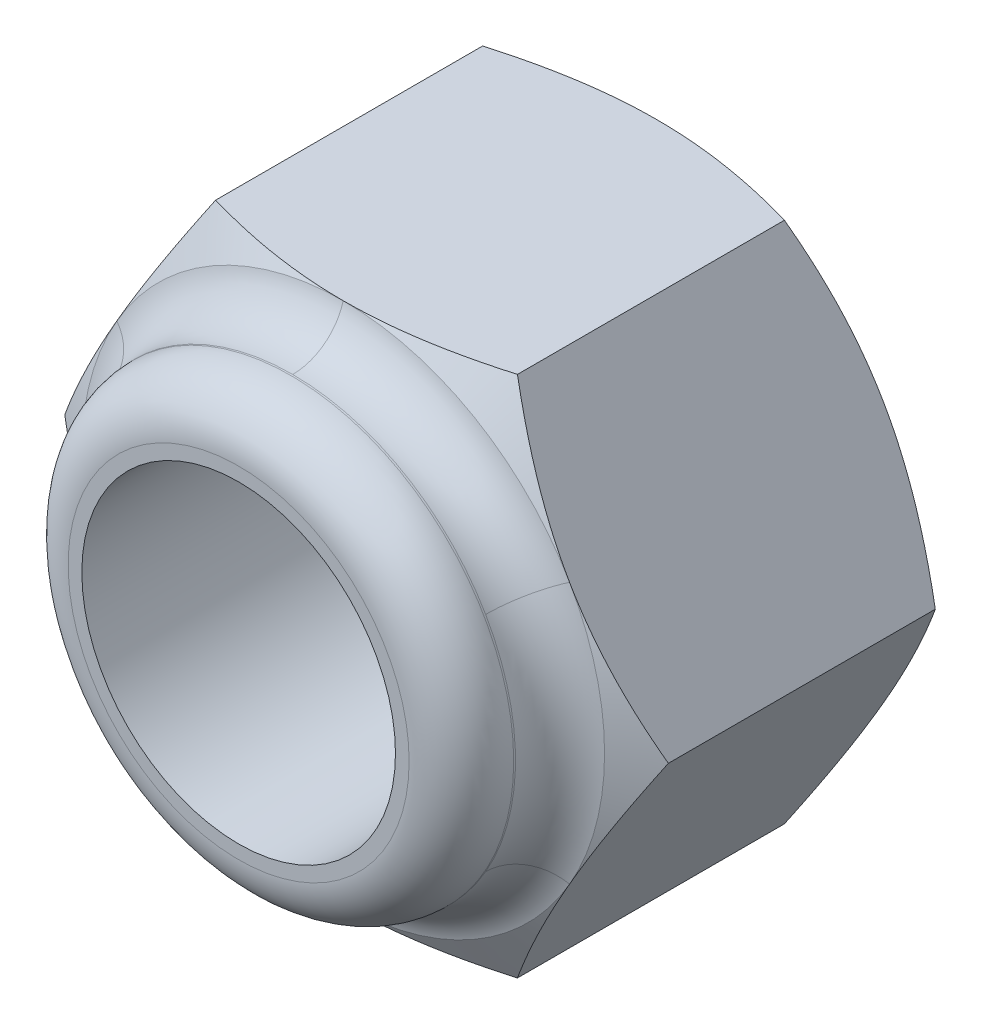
ISO-10303-21;
HEADER;
FILE_DESCRIPTION(('STEP AP214'),'2;1');
FILE_NAME('part.step','',(''),(''),'','','');
FILE_SCHEMA(('AUTOMOTIVE_DESIGN { 1 0 10303 214 1 1 1 1 }'));
ENDSEC;
DATA;
#1=APPLICATION_CONTEXT('core data for automotive mechanical design processes');
#2=APPLICATION_PROTOCOL_DEFINITION('international standard','automotive_design',2000,#1);
#3=PRODUCT_CONTEXT('',#1,'mechanical');
#4=PRODUCT('Part','Part','',(#3));
#5=PRODUCT_RELATED_PRODUCT_CATEGORY('part','',(#4));
#6=PRODUCT_DEFINITION_FORMATION('','',#4);
#7=PRODUCT_DEFINITION_CONTEXT('part definition',#1,'design');
#8=PRODUCT_DEFINITION('design','',#6,#7);
#9=PRODUCT_DEFINITION_SHAPE('','',#8);
#10=(LENGTH_UNIT() NAMED_UNIT(*) SI_UNIT(.MILLI.,.METRE.));
#11=(NAMED_UNIT(*) PLANE_ANGLE_UNIT() SI_UNIT($,.RADIAN.));
#12=(NAMED_UNIT(*) SI_UNIT($,.STERADIAN.) SOLID_ANGLE_UNIT());
#13=UNCERTAINTY_MEASURE_WITH_UNIT(LENGTH_MEASURE(1.E-05),#10,'distance_accuracy_value','');
#14=(GEOMETRIC_REPRESENTATION_CONTEXT(3) GLOBAL_UNCERTAINTY_ASSIGNED_CONTEXT((#13)) GLOBAL_UNIT_ASSIGNED_CONTEXT((#10,
#11,#12)) REPRESENTATION_CONTEXT('',''));
#15=CARTESIAN_POINT('',(0.,0.,0.));
#16=DIRECTION('',(0.,0.,1.));
#17=DIRECTION('',(1.,0.,0.));
#18=AXIS2_PLACEMENT_3D('',#15,#16,#17);
#19=CARTESIAN_POINT('',(-5.77350269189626,0.,6.));
#20=DIRECTION('',(-0.866025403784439,0.5,0.));
#21=DIRECTION('',(-0.5,-0.866025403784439,0.));
#22=AXIS2_PLACEMENT_3D('',#19,#20,#21);
#23=PLANE('',#22);
#24=DIRECTION('',(0.,0.,-1.));
#25=VECTOR('',#24,1.);
#26=CARTESIAN_POINT('',(-5.77350269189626,0.,6.));
#27=LINE('',#26,#25);
#28=CARTESIAN_POINT('',(-5.77350269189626,0.,5.5534180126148));
#29=VERTEX_POINT('',#28);
#30=CARTESIAN_POINT('',(-5.77350269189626,0.,0.446581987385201));
#31=VERTEX_POINT('',#30);
#32=EDGE_CURVE('E171',#29,#31,#27,.T.);
#33=ORIENTED_EDGE('',*,*,#32,.F.);
#34=CARTESIAN_POINT('',(-5.7736181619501,-0.0002,5.55335134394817));
#35=CARTESIAN_POINT('',(-5.64675433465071,0.219534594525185,5.62661343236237));
#36=CARTESIAN_POINT('',(-5.5188054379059,0.441148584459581,5.69324867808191));
#37=CARTESIAN_POINT('',(-5.26069210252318,0.888213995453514,5.80956100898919));
#38=CARTESIAN_POINT('',(-5.13052307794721,1.11367335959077,5.85919695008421));
#39=CARTESIAN_POINT('',(-4.87177839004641,1.56183230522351,5.9364489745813));
#40=CARTESIAN_POINT('',(-4.74324302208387,1.78446209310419,5.96457962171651));
#41=CARTESIAN_POINT('',(-4.54998783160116,2.11918990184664,5.98980507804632));
#42=CARTESIAN_POINT('',(-4.48552534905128,2.23084219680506,5.99538654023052));
#43=CARTESIAN_POINT('',(-4.35654081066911,2.4542499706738,6.00079778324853));
#44=CARTESIAN_POINT('',(-4.2920187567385,2.56600544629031,6.0006277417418));
#45=CARTESIAN_POINT('',(-4.11524635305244,2.87218423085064,5.99224636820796));
#46=CARTESIAN_POINT('',(-4.00305457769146,3.06650608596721,5.97817022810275));
#47=CARTESIAN_POINT('',(-3.77941563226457,3.45386010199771,5.93353474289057));
#48=CARTESIAN_POINT('',(-3.66796924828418,3.64689090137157,5.90296013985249));
#49=CARTESIAN_POINT('',(-3.44387972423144,4.03502534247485,5.82653150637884));
#50=CARTESIAN_POINT('',(-3.3312648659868,4.23007999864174,5.78035362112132));
#51=CARTESIAN_POINT('',(-3.1077146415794,4.61728034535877,5.67554820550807));
#52=CARTESIAN_POINT('',(-2.99677641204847,4.80943099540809,5.61694529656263));
#53=CARTESIAN_POINT('',(-2.88663587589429,5.0002,5.55335134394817));
#54=B_SPLINE_CURVE_WITH_KNOTS('',3,(#34,#35,#36,#37,#38,#39,#40,#41,#42,#43,#44,#45,#46,#47,#48,
#49,#50,#51,#52,#53),.UNSPECIFIED.,.F.,.F.,(4,2,2,2,2,2,2,2,2,4),(0.,0.792555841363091,
1.58701660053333,2.36181537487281,2.74884076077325,3.13585419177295,3.80962362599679,
4.48401723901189,5.17336882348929,5.86136694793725),.UNSPECIFIED.);
#55=CARTESIAN_POINT('',(-4.33012701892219,2.5,6.));
#56=VERTEX_POINT('',#55);
#57=EDGE_CURVE('E151',#29,#56,#54,.T.);
#58=ORIENTED_EDGE('',*,*,#57,.T.);
#59=CARTESIAN_POINT('',(-2.88675134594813,5.,5.5534180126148));
#60=VERTEX_POINT('',#59);
#61=EDGE_CURVE('E141',#56,#60,#54,.T.);
#62=ORIENTED_EDGE('',*,*,#61,.T.);
#63=DIRECTION('',(0.,0.,-1.));
#64=VECTOR('',#63,1.);
#65=CARTESIAN_POINT('',(-2.88675134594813,5.,6.));
#66=LINE('',#65,#64);
#67=CARTESIAN_POINT('',(-2.88675134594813,5.,0.446581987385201));
#68=VERTEX_POINT('',#67);
#69=EDGE_CURVE('E393',#60,#68,#66,.T.);
#70=ORIENTED_EDGE('',*,*,#69,.T.);
#71=CARTESIAN_POINT('',(-2.88663587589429,5.0002,0.446648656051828));
#72=CARTESIAN_POINT('',(-3.01349970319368,4.78046540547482,0.373386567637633));
#73=CARTESIAN_POINT('',(-3.14144859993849,4.55885141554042,0.306751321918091));
#74=CARTESIAN_POINT('',(-3.39956193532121,4.11178600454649,0.190438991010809));
#75=CARTESIAN_POINT('',(-3.52973095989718,3.88632664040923,0.140803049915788));
#76=CARTESIAN_POINT('',(-3.78847564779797,3.43816769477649,0.0635510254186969));
#77=CARTESIAN_POINT('',(-3.91701101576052,3.21553790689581,0.0354203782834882));
#78=CARTESIAN_POINT('',(-4.11026620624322,2.88081009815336,0.0101949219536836));
#79=CARTESIAN_POINT('',(-4.17472868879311,2.76915780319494,0.00461345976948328));
#80=CARTESIAN_POINT('',(-4.30371322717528,2.5457500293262,-0.000797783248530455));
#81=CARTESIAN_POINT('',(-4.36823528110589,2.43399455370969,-0.000627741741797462));
#82=CARTESIAN_POINT('',(-4.54500768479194,2.12781576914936,0.00775363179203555));
#83=CARTESIAN_POINT('',(-4.65719946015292,1.93349391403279,0.0218297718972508));
#84=CARTESIAN_POINT('',(-4.88083840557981,1.54613989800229,0.0664652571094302));
#85=CARTESIAN_POINT('',(-4.9922847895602,1.35310909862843,0.0970398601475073));
#86=CARTESIAN_POINT('',(-5.21637431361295,0.964974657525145,0.173468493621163));
#87=CARTESIAN_POINT('',(-5.32898917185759,0.769920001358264,0.21964637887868));
#88=CARTESIAN_POINT('',(-5.55253939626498,0.382719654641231,0.324451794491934));
#89=CARTESIAN_POINT('',(-5.66347762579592,0.190569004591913,0.383054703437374));
#90=CARTESIAN_POINT('',(-5.7736181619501,-0.000200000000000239,0.446648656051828));
#91=B_SPLINE_CURVE_WITH_KNOTS('',3,(#71,#72,#73,#74,#75,#76,#77,#78,#79,#80,#81,#82,#83,#84,#85,
#86,#87,#88,#89,#90),.UNSPECIFIED.,.F.,.F.,(4,2,2,2,2,2,2,2,2,4),(0.,0.792555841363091,
1.58701660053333,2.36181537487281,2.74884076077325,3.13585419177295,3.80962362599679,
4.48401723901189,5.17336882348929,5.86136694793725),.UNSPECIFIED.);
#92=CARTESIAN_POINT('',(-4.33012701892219,2.5,0.));
#93=VERTEX_POINT('',#92);
#94=EDGE_CURVE('E317',#68,#93,#91,.T.);
#95=ORIENTED_EDGE('',*,*,#94,.T.);
#96=EDGE_CURVE('E312',#93,#31,#91,.T.);
#97=ORIENTED_EDGE('',*,*,#96,.T.);
#98=EDGE_LOOP('',(#33,#58,#62,#70,#95,#97));
#99=FACE_BOUND('',#98,.T.);
#100=ADVANCED_FACE('F33',(#99),#23,.T.);
#101=CARTESIAN_POINT('',(-2.88675134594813,-5.,6.));
#102=DIRECTION('',(-0.866025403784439,-0.5,0.));
#103=DIRECTION('',(0.5,-0.866025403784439,0.));
#104=AXIS2_PLACEMENT_3D('',#101,#102,#103);
#105=PLANE('',#104);
#106=DIRECTION('',(0.,0.,-1.));
#107=VECTOR('',#106,1.);
#108=CARTESIAN_POINT('',(-2.88675134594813,-5.,6.));
#109=LINE('',#108,#107);
#110=CARTESIAN_POINT('',(-2.88675134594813,-5.,5.5534180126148));
#111=VERTEX_POINT('',#110);
#112=CARTESIAN_POINT('',(-2.88675134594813,-5.,0.446581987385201));
#113=VERTEX_POINT('',#112);
#114=EDGE_CURVE('E403',#111,#113,#109,.T.);
#115=ORIENTED_EDGE('',*,*,#114,.F.);
#116=CARTESIAN_POINT('',(-2.88663587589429,-5.0002,5.55335134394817));
#117=CARTESIAN_POINT('',(-3.01349970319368,-4.78046540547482,5.62661343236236));
#118=CARTESIAN_POINT('',(-3.14144859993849,-4.55885141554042,5.69324867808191));
#119=CARTESIAN_POINT('',(-3.39956193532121,-4.11178600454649,5.80956100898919));
#120=CARTESIAN_POINT('',(-3.52973095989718,-3.88632664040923,5.85919695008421));
#121=CARTESIAN_POINT('',(-3.78847564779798,-3.43816769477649,5.9364489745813));
#122=CARTESIAN_POINT('',(-3.91701101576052,-3.21553790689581,5.96457962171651));
#123=CARTESIAN_POINT('',(-4.11026620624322,-2.88081009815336,5.98980507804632));
#124=CARTESIAN_POINT('',(-4.17472868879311,-2.76915780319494,5.99538654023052));
#125=CARTESIAN_POINT('',(-4.30371322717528,-2.5457500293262,6.00079778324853));
#126=CARTESIAN_POINT('',(-4.36823528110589,-2.43399455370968,6.0006277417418));
#127=CARTESIAN_POINT('',(-4.54500768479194,-2.12781576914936,5.99224636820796));
#128=CARTESIAN_POINT('',(-4.65719946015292,-1.93349391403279,5.97817022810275));
#129=CARTESIAN_POINT('',(-4.88083840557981,-1.54613989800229,5.93353474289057));
#130=CARTESIAN_POINT('',(-4.9922847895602,-1.35310909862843,5.90296013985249));
#131=CARTESIAN_POINT('',(-5.21637431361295,-0.964974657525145,5.82653150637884));
#132=CARTESIAN_POINT('',(-5.32898917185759,-0.769920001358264,5.78035362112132));
#133=CARTESIAN_POINT('',(-5.55253939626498,-0.382719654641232,5.67554820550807));
#134=CARTESIAN_POINT('',(-5.66347762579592,-0.190569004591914,5.61694529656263));
#135=CARTESIAN_POINT('',(-5.77361816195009,0.000199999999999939,5.55335134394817));
#136=B_SPLINE_CURVE_WITH_KNOTS('',3,(#116,#117,#118,#119,#120,#121,#122,#123,#124,#125,#126,
#127,#128,#129,#130,#131,#132,#133,#134,#135),.UNSPECIFIED.,.F.,.F.,(4,2,2,2,2,2,2,2,2,4),(0.,
0.792555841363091,1.58701660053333,2.36181537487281,2.74884076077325,3.13585419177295,
3.80962362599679,4.48401723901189,5.17336882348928,5.86136694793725),.UNSPECIFIED.);
#137=CARTESIAN_POINT('',(-4.33012701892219,-2.5,6.));
#138=VERTEX_POINT('',#137);
#139=EDGE_CURVE('E273',#111,#138,#136,.T.);
#140=ORIENTED_EDGE('',*,*,#139,.T.);
#141=EDGE_CURVE('E160',#138,#29,#136,.T.);
#142=ORIENTED_EDGE('',*,*,#141,.T.);
#143=ORIENTED_EDGE('',*,*,#32,.T.);
#144=CARTESIAN_POINT('',(-5.77361816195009,0.0002,0.446648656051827));
#145=CARTESIAN_POINT('',(-5.64675433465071,-0.219534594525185,0.373386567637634));
#146=CARTESIAN_POINT('',(-5.5188054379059,-0.441148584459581,0.306751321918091));
#147=CARTESIAN_POINT('',(-5.26069210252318,-0.888213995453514,0.19043899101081));
#148=CARTESIAN_POINT('',(-5.13052307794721,-1.11367335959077,0.140803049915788));
#149=CARTESIAN_POINT('',(-4.87177839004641,-1.56183230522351,0.0635510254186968));
#150=CARTESIAN_POINT('',(-4.74324302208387,-1.78446209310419,0.0354203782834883));
#151=CARTESIAN_POINT('',(-4.54998783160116,-2.11918990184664,0.0101949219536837));
#152=CARTESIAN_POINT('',(-4.48552534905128,-2.23084219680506,0.0046134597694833));
#153=CARTESIAN_POINT('',(-4.35654081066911,-2.4542499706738,-0.00079778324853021));
#154=CARTESIAN_POINT('',(-4.2920187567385,-2.56600544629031,-0.000627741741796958));
#155=CARTESIAN_POINT('',(-4.11524635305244,-2.87218423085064,0.00775363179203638));
#156=CARTESIAN_POINT('',(-4.00305457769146,-3.06650608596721,0.0218297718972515));
#157=CARTESIAN_POINT('',(-3.77941563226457,-3.45386010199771,0.0664652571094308));
#158=CARTESIAN_POINT('',(-3.66796924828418,-3.64689090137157,0.097039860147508));
#159=CARTESIAN_POINT('',(-3.44387972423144,-4.03502534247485,0.173468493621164));
#160=CARTESIAN_POINT('',(-3.3312648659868,-4.23007999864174,0.21964637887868));
#161=CARTESIAN_POINT('',(-3.1077146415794,-4.61728034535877,0.324451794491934));
#162=CARTESIAN_POINT('',(-2.99677641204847,-4.80943099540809,0.383054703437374));
#163=CARTESIAN_POINT('',(-2.88663587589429,-5.0002,0.446648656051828));
#164=B_SPLINE_CURVE_WITH_KNOTS('',3,(#144,#145,#146,#147,#148,#149,#150,#151,#152,#153,#154,
#155,#156,#157,#158,#159,#160,#161,#162,#163),.UNSPECIFIED.,.F.,.F.,(4,2,2,2,2,2,2,2,2,4),(0.,
0.792555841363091,1.58701660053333,2.36181537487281,2.74884076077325,3.13585419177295,
3.80962362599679,4.48401723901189,5.17336882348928,5.86136694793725),.UNSPECIFIED.);
#165=CARTESIAN_POINT('',(-4.33012701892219,-2.5,0.));
#166=VERTEX_POINT('',#165);
#167=EDGE_CURVE('E311',#31,#166,#164,.T.);
#168=ORIENTED_EDGE('',*,*,#167,.T.);
#169=EDGE_CURVE('E305',#166,#113,#164,.T.);
#170=ORIENTED_EDGE('',*,*,#169,.T.);
#171=EDGE_LOOP('',(#115,#140,#142,#143,#168,#170));
#172=FACE_BOUND('',#171,.T.);
#173=ADVANCED_FACE('F35',(#172),#105,.T.);
#174=CARTESIAN_POINT('',(2.88675134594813,-5.,6.));
#175=DIRECTION('',(0.,-1.,0.));
#176=DIRECTION('',(0.,0.,-1.));
#177=AXIS2_PLACEMENT_3D('',#174,#175,#176);
#178=PLANE('',#177);
#179=DIRECTION('',(0.,0.,-1.));
#180=VECTOR('',#179,1.);
#181=CARTESIAN_POINT('',(2.88675134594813,-5.,6.));
#182=LINE('',#181,#180);
#183=CARTESIAN_POINT('',(2.88675134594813,-5.,5.5534180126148));
#184=VERTEX_POINT('',#183);
#185=CARTESIAN_POINT('',(2.88675134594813,-5.,0.446581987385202));
#186=VERTEX_POINT('',#185);
#187=EDGE_CURVE('E401',#184,#186,#182,.T.);
#188=ORIENTED_EDGE('',*,*,#187,.F.);
#189=CARTESIAN_POINT('',(-7.66597034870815,-5.,3.60258943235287));
#190=CARTESIAN_POINT('',(-7.44636495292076,-5.,3.70875587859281));
#191=CARTESIAN_POINT('',(-7.22624145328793,-5.,3.81386996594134));
#192=CARTESIAN_POINT('',(-6.78467816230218,-5.,4.02139229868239));
#193=CARTESIAN_POINT('',(-6.56323815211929,-5.,4.12380007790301));
#194=CARTESIAN_POINT('',(-6.1175704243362,-5.,4.325846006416));
#195=CARTESIAN_POINT('',(-5.89333401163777,-5.,4.42546504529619));
#196=CARTESIAN_POINT('',(-5.44302179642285,-5.,4.62043845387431));
#197=CARTESIAN_POINT('',(-5.21694609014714,-5.,4.7157930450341));
#198=CARTESIAN_POINT('',(-4.75974332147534,-5.,4.90225488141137));
#199=CARTESIAN_POINT('',(-4.52858843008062,-5.,4.99329426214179));
#200=CARTESIAN_POINT('',(-4.06355549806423,-5.,5.16826743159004));
#201=CARTESIAN_POINT('',(-3.82967715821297,-5.,5.2522004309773));
#202=CARTESIAN_POINT('',(-3.35930314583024,-5.,5.41071302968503));
#203=CARTESIAN_POINT('',(-3.12281421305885,-5.,5.48531242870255));
#204=CARTESIAN_POINT('',(-2.64647143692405,-5.,5.62274061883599));
#205=CARTESIAN_POINT('',(-2.40661868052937,-5.,5.68557312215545));
#206=CARTESIAN_POINT('',(-1.92340007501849,-5.,5.79642571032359));
#207=CARTESIAN_POINT('',(-1.68003342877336,-5.,5.84444237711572));
#208=CARTESIAN_POINT('',(-1.19032080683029,-5.,5.92242694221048));
#209=CARTESIAN_POINT('',(-0.94397483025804,-5.,5.95239483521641));
#210=CARTESIAN_POINT('',(-0.574057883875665,-5.,5.98188923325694));
#211=CARTESIAN_POINT('',(-0.451072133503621,-5.,5.98914564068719));
#212=CARTESIAN_POINT('',(-0.204898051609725,-5.,5.99844609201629));
#213=CARTESIAN_POINT('',(-0.0817097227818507,-5.,6.00049020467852));
#214=CARTESIAN_POINT('',(0.164605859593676,-5.,5.99931142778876));
#215=CARTESIAN_POINT('',(0.28773312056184,-5.,5.99609002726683));
#216=CARTESIAN_POINT('',(0.533744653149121,-5.,5.98446218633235));
#217=CARTESIAN_POINT('',(0.656628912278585,-5.,5.97605548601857));
#218=CARTESIAN_POINT('',(0.954158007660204,-5.,5.94959882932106));
#219=CARTESIAN_POINT('',(1.12857705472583,-5.,5.9289676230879));
#220=CARTESIAN_POINT('',(1.47606089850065,-5.,5.87840458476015));
#221=CARTESIAN_POINT('',(1.649125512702,-5.,5.84847152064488));
#222=CARTESIAN_POINT('',(1.99378931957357,-5.,5.78036333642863));
#223=CARTESIAN_POINT('',(2.16538687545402,-5.,5.74218001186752));
#224=CARTESIAN_POINT('',(2.5068253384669,-5.,5.65873641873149));
#225=CARTESIAN_POINT('',(2.67666635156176,-5.,5.61347657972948));
#226=CARTESIAN_POINT('',(3.01877977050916,-5.,5.515778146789));
#227=CARTESIAN_POINT('',(3.19100929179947,-5.,5.46319041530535));
#228=CARTESIAN_POINT('',(3.53364807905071,-5.,5.3527979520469));
#229=CARTESIAN_POINT('',(3.70405850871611,-5.,5.29499681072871));
#230=CARTESIAN_POINT('',(4.04237551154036,-5.,5.17537322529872));
#231=CARTESIAN_POINT('',(4.21029077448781,-5.,5.11357520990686));
#232=CARTESIAN_POINT('',(4.54481672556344,-5.,4.98633841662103));
#233=CARTESIAN_POINT('',(4.71142685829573,-5.,4.92089817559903));
#234=CARTESIAN_POINT('',(4.87743079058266,-5.,4.85399665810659));
#235=B_SPLINE_CURVE_WITH_KNOTS('',3,(#189,#190,#191,#192,#193,#194,#195,#196,#197,#198,#199,
#200,#201,#202,#203,#204,#205,#206,#207,#208,#209,#210,#211,#212,#213,#214,#215,#216,#217,#218,
#219,#220,#221,#222,#223,#224,#225,#226,#227,#228,#229,#230,#231,#232,#233,#234),.UNSPECIFIED.,
.F.,.F.,(4,2,2,2,2,2,2,2,2,2,2,2,2,2,2,2,2,2,2,2,2,2,4),(0.,0.731775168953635,1.46367557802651,
2.19974713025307,2.93578041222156,3.68100006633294,4.42630238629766,5.1699958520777,
5.91345430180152,6.65708414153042,7.40071419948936,7.77021927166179,8.13971946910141,
8.50911519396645,8.87852943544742,9.40514124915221,9.93182284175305,10.4590306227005,
10.9862064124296,11.5263432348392,12.0661108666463,12.602844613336,13.1397955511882),.UNSPECIFIED.);
#236=CARTESIAN_POINT('',(0.,-5.,6.));
#237=VERTEX_POINT('',#236);
#238=EDGE_CURVE('E280',#184,#237,#235,.F.);
#239=ORIENTED_EDGE('',*,*,#238,.T.);
#240=EDGE_CURVE('E274',#237,#111,#235,.F.);
#241=ORIENTED_EDGE('',*,*,#240,.T.);
#242=ORIENTED_EDGE('',*,*,#114,.T.);
#243=CARTESIAN_POINT('',(-7.65902487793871,-5.,2.39405232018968));
#244=CARTESIAN_POINT('',(-7.43947373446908,-5.,2.28794089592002));
#245=CARTESIAN_POINT('',(-7.21940383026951,-5.,2.1828834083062));
#246=CARTESIAN_POINT('',(-6.77794602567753,-5.,1.97547849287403));
#247=CARTESIAN_POINT('',(-6.55655790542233,-5.,1.87313153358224));
#248=CARTESIAN_POINT('',(-6.11098872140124,-5.,1.67121133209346));
#249=CARTESIAN_POINT('',(-5.88679892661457,-5.,1.57165728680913));
#250=CARTESIAN_POINT('',(-5.43657776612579,-5.,1.37682106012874));
#251=CARTESIAN_POINT('',(-5.21054649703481,-5.,1.28153865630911));
#252=CARTESIAN_POINT('',(-4.75346330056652,-5.,1.09524467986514));
#253=CARTESIAN_POINT('',(-4.52238383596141,-5.,1.00430030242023));
#254=CARTESIAN_POINT('',(-4.05750017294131,-5.,0.829527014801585));
#255=CARTESIAN_POINT('',(-3.82369567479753,-5.,0.745698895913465));
#256=CARTESIAN_POINT('',(-3.35347003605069,-5.,0.587408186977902));
#257=CARTESIAN_POINT('',(-3.11705565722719,-5.,0.512925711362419));
#258=CARTESIAN_POINT('',(-2.64086337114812,-5.,0.375744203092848));
#259=CARTESIAN_POINT('',(-2.40108655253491,-5.,0.313041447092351));
#260=CARTESIAN_POINT('',(-1.91801837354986,-5.,0.202458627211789));
#261=CARTESIAN_POINT('',(-1.67472613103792,-5.,0.154582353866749));
#262=CARTESIAN_POINT('',(-1.18517100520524,-5.,0.0768854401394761));
#263=CARTESIAN_POINT('',(-0.938908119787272,-5.,0.0470648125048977));
#264=CARTESIAN_POINT('',(-0.569120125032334,-5.,0.0177871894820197));
#265=CARTESIAN_POINT('',(-0.446175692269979,-5.,0.0106021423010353));
#266=CARTESIAN_POINT('',(-0.200087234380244,-5.,0.0014419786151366));
#267=CARTESIAN_POINT('',(-0.0769432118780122,-5.,-0.000533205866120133));
#268=CARTESIAN_POINT('',(0.169281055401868,-5.,0.000779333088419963));
#269=CARTESIAN_POINT('',(0.292361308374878,-5.,0.00406557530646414));
#270=CARTESIAN_POINT('',(0.538276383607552,-5.,0.0158175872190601));
#271=CARTESIAN_POINT('',(0.661111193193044,-5.,0.0242836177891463));
#272=CARTESIAN_POINT('',(0.958742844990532,-5.,0.0508962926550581));
#273=CARTESIAN_POINT('',(1.13331178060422,-5.,0.0716338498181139));
#274=CARTESIAN_POINT('',(1.48108954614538,-5.,0.122417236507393));
#275=CARTESIAN_POINT('',(1.65429819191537,-5.,0.152464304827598));
#276=CARTESIAN_POINT('',(1.99924567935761,-5.,0.220804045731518));
#277=CARTESIAN_POINT('',(2.17098287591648,-5.,0.259104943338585));
#278=CARTESIAN_POINT('',(2.51269698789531,-5.,0.342784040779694));
#279=CARTESIAN_POINT('',(2.68267400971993,-5.,0.388161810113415));
#280=CARTESIAN_POINT('',(3.0250496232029,-5.,0.486094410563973));
#281=CARTESIAN_POINT('',(3.19740538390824,-5.,0.53879795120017));
#282=CARTESIAN_POINT('',(3.5402951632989,-5.,0.649418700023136));
#283=CARTESIAN_POINT('',(3.71083034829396,-5.,0.707332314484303));
#284=CARTESIAN_POINT('',(4.04939473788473,-5.,0.827176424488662));
#285=CARTESIAN_POINT('',(4.21743264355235,-5.,0.889082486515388));
#286=CARTESIAN_POINT('',(4.55220418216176,-5.,1.01653217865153));
#287=CARTESIAN_POINT('',(4.7189372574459,-5.,1.08207727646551));
#288=CARTESIAN_POINT('',(4.8850643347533,-5.,1.14908204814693));
#289=B_SPLINE_CURVE_WITH_KNOTS('',3,(#243,#244,#245,#246,#247,#248,#249,#250,#251,#252,#253,
#254,#255,#256,#257,#258,#259,#260,#261,#262,#263,#264,#265,#266,#267,#268,#269,#270,#271,#272,
#273,#274,#275,#276,#277,#278,#279,#280,#281,#282,#283,#284,#285,#286,#287,#288),.UNSPECIFIED.,
.F.,.F.,(4,2,2,2,2,2,2,2,2,2,2,2,2,2,2,2,2,2,2,2,2,2,4),(0.,0.731556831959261,1.46323930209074,
2.19910377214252,2.93492988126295,3.67983429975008,4.42482143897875,5.16819550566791,
5.91133420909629,6.65466274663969,7.39799180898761,7.76736064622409,8.1367246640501,
8.50598471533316,8.87526336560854,9.40235883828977,9.92952448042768,10.4572178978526,
10.9848792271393,11.5254799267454,12.0657105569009,12.6029016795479,13.1403110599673),.UNSPECIFIED.);
#290=CARTESIAN_POINT('',(0.,-5.,0.));
#291=VERTEX_POINT('',#290);
#292=EDGE_CURVE('E299',#113,#291,#289,.T.);
#293=ORIENTED_EDGE('',*,*,#292,.T.);
#294=EDGE_CURVE('E292',#291,#186,#289,.T.);
#295=ORIENTED_EDGE('',*,*,#294,.T.);
#296=EDGE_LOOP('',(#188,#239,#241,#242,#293,#295));
#297=FACE_BOUND('',#296,.T.);
#298=ADVANCED_FACE('F284',(#297),#178,.T.);
#299=CARTESIAN_POINT('',(5.77350269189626,0.,6.));
#300=DIRECTION('',(0.866025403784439,-0.5,0.));
#301=DIRECTION('',(0.5,0.866025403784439,0.));
#302=AXIS2_PLACEMENT_3D('',#299,#300,#301);
#303=PLANE('',#302);
#304=DIRECTION('',(0.,0.,-1.));
#305=VECTOR('',#304,1.);
#306=CARTESIAN_POINT('',(5.77350269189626,0.,6.));
#307=LINE('',#306,#305);
#308=CARTESIAN_POINT('',(5.77350269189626,0.,5.5534180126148));
#309=VERTEX_POINT('',#308);
#310=CARTESIAN_POINT('',(5.77350269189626,0.,0.446581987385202));
#311=VERTEX_POINT('',#310);
#312=EDGE_CURVE('E387',#309,#311,#307,.T.);
#313=ORIENTED_EDGE('',*,*,#312,.F.);
#314=CARTESIAN_POINT('',(5.7736181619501,0.000200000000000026,5.55335134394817));
#315=CARTESIAN_POINT('',(5.64675433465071,-0.219534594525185,5.62661343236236));
#316=CARTESIAN_POINT('',(5.5188054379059,-0.441148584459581,5.69324867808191));
#317=CARTESIAN_POINT('',(5.26069210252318,-0.888213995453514,5.80956100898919));
#318=CARTESIAN_POINT('',(5.13052307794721,-1.11367335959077,5.85919695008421));
#319=CARTESIAN_POINT('',(4.87177839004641,-1.56183230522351,5.9364489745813));
#320=CARTESIAN_POINT('',(4.74324302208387,-1.78446209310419,5.96457962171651));
#321=CARTESIAN_POINT('',(4.54998783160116,-2.11918990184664,5.98980507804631));
#322=CARTESIAN_POINT('',(4.48552534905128,-2.23084219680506,5.99538654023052));
#323=CARTESIAN_POINT('',(4.35654081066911,-2.4542499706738,6.00079778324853));
#324=CARTESIAN_POINT('',(4.2920187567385,-2.56600544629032,6.0006277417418));
#325=CARTESIAN_POINT('',(4.11524635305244,-2.87218423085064,5.99224636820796));
#326=CARTESIAN_POINT('',(4.00305457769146,-3.06650608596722,5.97817022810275));
#327=CARTESIAN_POINT('',(3.77941563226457,-3.45386010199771,5.93353474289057));
#328=CARTESIAN_POINT('',(3.66796924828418,-3.64689090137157,5.90296013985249));
#329=CARTESIAN_POINT('',(3.44387972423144,-4.03502534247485,5.82653150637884));
#330=CARTESIAN_POINT('',(3.3312648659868,-4.23007999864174,5.78035362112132));
#331=CARTESIAN_POINT('',(3.1077146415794,-4.61728034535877,5.67554820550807));
#332=CARTESIAN_POINT('',(2.99677641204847,-4.80943099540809,5.61694529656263));
#333=CARTESIAN_POINT('',(2.88663587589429,-5.0002,5.55335134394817));
#334=B_SPLINE_CURVE_WITH_KNOTS('',3,(#314,#315,#316,#317,#318,#319,#320,#321,#322,#323,#324,
#325,#326,#327,#328,#329,#330,#331,#332,#333),.UNSPECIFIED.,.F.,.F.,(4,2,2,2,2,2,2,2,2,4),(0.,
0.792555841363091,1.58701660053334,2.36181537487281,2.74884076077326,3.13585419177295,
3.80962362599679,4.48401723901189,5.17336882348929,5.86136694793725),.UNSPECIFIED.);
#335=CARTESIAN_POINT('',(4.33012701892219,-2.5,6.));
#336=VERTEX_POINT('',#335);
#337=EDGE_CURVE('E264',#309,#336,#334,.T.);
#338=ORIENTED_EDGE('',*,*,#337,.T.);
#339=EDGE_CURVE('E281',#336,#184,#334,.T.);
#340=ORIENTED_EDGE('',*,*,#339,.T.);
#341=ORIENTED_EDGE('',*,*,#187,.T.);
#342=CARTESIAN_POINT('',(2.88663587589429,-5.0002,0.446648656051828));
#343=CARTESIAN_POINT('',(3.01349970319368,-4.78046540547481,0.373386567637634));
#344=CARTESIAN_POINT('',(3.14144859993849,-4.55885141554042,0.306751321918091));
#345=CARTESIAN_POINT('',(3.39956193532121,-4.11178600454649,0.19043899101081));
#346=CARTESIAN_POINT('',(3.52973095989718,-3.88632664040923,0.140803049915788));
#347=CARTESIAN_POINT('',(3.78847564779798,-3.43816769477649,0.0635510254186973));
#348=CARTESIAN_POINT('',(3.91701101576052,-3.21553790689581,0.0354203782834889));
#349=CARTESIAN_POINT('',(4.11026620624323,-2.88081009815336,0.010194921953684));
#350=CARTESIAN_POINT('',(4.17472868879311,-2.76915780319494,0.00461345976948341));
#351=CARTESIAN_POINT('',(4.30371322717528,-2.5457500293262,-0.00079778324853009));
#352=CARTESIAN_POINT('',(4.36823528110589,-2.43399455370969,-0.000627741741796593));
#353=CARTESIAN_POINT('',(4.54500768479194,-2.12781576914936,0.00775363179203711));
#354=CARTESIAN_POINT('',(4.65719946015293,-1.93349391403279,0.021829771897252));
#355=CARTESIAN_POINT('',(4.88083840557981,-1.54613989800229,0.0664652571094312));
#356=CARTESIAN_POINT('',(4.9922847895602,-1.35310909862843,0.0970398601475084));
#357=CARTESIAN_POINT('',(5.21637431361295,-0.964974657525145,0.173468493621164));
#358=CARTESIAN_POINT('',(5.32898917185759,-0.769920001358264,0.21964637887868));
#359=CARTESIAN_POINT('',(5.55253939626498,-0.382719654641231,0.324451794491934));
#360=CARTESIAN_POINT('',(5.66347762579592,-0.190569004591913,0.383054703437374));
#361=CARTESIAN_POINT('',(5.7736181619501,0.000199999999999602,0.446648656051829));
#362=B_SPLINE_CURVE_WITH_KNOTS('',3,(#342,#343,#344,#345,#346,#347,#348,#349,#350,#351,#352,
#353,#354,#355,#356,#357,#358,#359,#360,#361),.UNSPECIFIED.,.F.,.F.,(4,2,2,2,2,2,2,2,2,4),(0.,
0.792555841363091,1.58701660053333,2.36181537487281,2.74884076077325,3.13585419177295,
3.80962362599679,4.48401723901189,5.17336882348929,5.86136694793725),.UNSPECIFIED.);
#363=CARTESIAN_POINT('',(4.33012701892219,-2.5,0.));
#364=VERTEX_POINT('',#363);
#365=EDGE_CURVE('E300',#186,#364,#362,.T.);
#366=ORIENTED_EDGE('',*,*,#365,.T.);
#367=EDGE_CURVE('E301',#364,#311,#362,.T.);
#368=ORIENTED_EDGE('',*,*,#367,.T.);
#369=EDGE_LOOP('',(#313,#338,#340,#341,#366,#368));
#370=FACE_BOUND('',#369,.T.);
#371=ADVANCED_FACE('F287',(#370),#303,.T.);
#372=CARTESIAN_POINT('',(2.88675134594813,5.,6.));
#373=DIRECTION('',(0.866025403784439,0.5,0.));
#374=DIRECTION('',(-0.5,0.866025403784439,0.));
#375=AXIS2_PLACEMENT_3D('',#372,#373,#374);
#376=PLANE('',#375);
#377=DIRECTION('',(0.,0.,-1.));
#378=VECTOR('',#377,1.);
#379=CARTESIAN_POINT('',(2.88675134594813,5.,6.));
#380=LINE('',#379,#378);
#381=CARTESIAN_POINT('',(2.88675134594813,5.,5.5534180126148));
#382=VERTEX_POINT('',#381);
#383=CARTESIAN_POINT('',(2.88675134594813,5.,0.446581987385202));
#384=VERTEX_POINT('',#383);
#385=EDGE_CURVE('E397',#382,#384,#380,.T.);
#386=ORIENTED_EDGE('',*,*,#385,.F.);
#387=CARTESIAN_POINT('',(2.88663587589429,5.0002,5.55335134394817));
#388=CARTESIAN_POINT('',(3.01349970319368,4.78046540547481,5.62661343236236));
#389=CARTESIAN_POINT('',(3.14144859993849,4.55885141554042,5.69324867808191));
#390=CARTESIAN_POINT('',(3.39956193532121,4.11178600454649,5.80956100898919));
#391=CARTESIAN_POINT('',(3.52973095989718,3.88632664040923,5.85919695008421));
#392=CARTESIAN_POINT('',(3.78847564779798,3.43816769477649,5.9364489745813));
#393=CARTESIAN_POINT('',(3.91701101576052,3.21553790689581,5.96457962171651));
#394=CARTESIAN_POINT('',(4.11026620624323,2.88081009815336,5.98980507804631));
#395=CARTESIAN_POINT('',(4.17472868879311,2.76915780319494,5.99538654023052));
#396=CARTESIAN_POINT('',(4.30371322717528,2.5457500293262,6.00079778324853));
#397=CARTESIAN_POINT('',(4.36823528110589,2.43399455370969,6.0006277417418));
#398=CARTESIAN_POINT('',(4.54500768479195,2.12781576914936,5.99224636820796));
#399=CARTESIAN_POINT('',(4.65719946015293,1.93349391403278,5.97817022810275));
#400=CARTESIAN_POINT('',(4.88083840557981,1.54613989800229,5.93353474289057));
#401=CARTESIAN_POINT('',(4.9922847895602,1.35310909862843,5.90296013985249));
#402=CARTESIAN_POINT('',(5.21637431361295,0.964974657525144,5.82653150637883));
#403=CARTESIAN_POINT('',(5.32898917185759,0.769920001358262,5.78035362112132));
#404=CARTESIAN_POINT('',(5.55253939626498,0.38271965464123,5.67554820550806));
#405=CARTESIAN_POINT('',(5.66347762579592,0.190569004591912,5.61694529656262));
#406=CARTESIAN_POINT('',(5.7736181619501,-0.000200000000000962,5.55335134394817));
#407=B_SPLINE_CURVE_WITH_KNOTS('',3,(#387,#388,#389,#390,#391,#392,#393,#394,#395,#396,#397,
#398,#399,#400,#401,#402,#403,#404,#405,#406),.UNSPECIFIED.,.F.,.F.,(4,2,2,2,2,2,2,2,2,4),(0.,
0.792555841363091,1.58701660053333,2.36181537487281,2.74884076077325,3.13585419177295,
3.80962362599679,4.48401723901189,5.17336882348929,5.86136694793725),.UNSPECIFIED.);
#408=CARTESIAN_POINT('',(4.33012701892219,2.5,6.));
#409=VERTEX_POINT('',#408);
#410=EDGE_CURVE('E152',#382,#409,#407,.T.);
#411=ORIENTED_EDGE('',*,*,#410,.T.);
#412=EDGE_CURVE('E172',#409,#309,#407,.T.);
#413=ORIENTED_EDGE('',*,*,#412,.T.);
#414=ORIENTED_EDGE('',*,*,#312,.T.);
#415=CARTESIAN_POINT('',(5.7736181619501,-0.000200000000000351,0.446648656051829));
#416=CARTESIAN_POINT('',(5.64675433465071,0.219534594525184,0.373386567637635));
#417=CARTESIAN_POINT('',(5.5188054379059,0.44114858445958,0.306751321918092));
#418=CARTESIAN_POINT('',(5.26069210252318,0.888213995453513,0.190438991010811));
#419=CARTESIAN_POINT('',(5.13052307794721,1.11367335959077,0.140803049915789));
#420=CARTESIAN_POINT('',(4.87177839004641,1.56183230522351,0.0635510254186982));
#421=CARTESIAN_POINT('',(4.74324302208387,1.78446209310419,0.0354203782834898));
#422=CARTESIAN_POINT('',(4.54998783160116,2.11918990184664,0.0101949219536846));
#423=CARTESIAN_POINT('',(4.48552534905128,2.23084219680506,0.00461345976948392));
#424=CARTESIAN_POINT('',(4.35654081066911,2.4542499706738,-0.000797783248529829));
#425=CARTESIAN_POINT('',(4.2920187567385,2.56600544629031,-0.000627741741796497));
#426=CARTESIAN_POINT('',(4.11524635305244,2.87218423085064,0.00775363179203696));
#427=CARTESIAN_POINT('',(4.00305457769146,3.06650608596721,0.021829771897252));
#428=CARTESIAN_POINT('',(3.77941563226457,3.45386010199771,0.0664652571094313));
#429=CARTESIAN_POINT('',(3.66796924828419,3.64689090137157,0.0970398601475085));
#430=CARTESIAN_POINT('',(3.44387972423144,4.03502534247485,0.173468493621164));
#431=CARTESIAN_POINT('',(3.3312648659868,4.23007999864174,0.21964637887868));
#432=CARTESIAN_POINT('',(3.1077146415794,4.61728034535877,0.324451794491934));
#433=CARTESIAN_POINT('',(2.99677641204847,4.80943099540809,0.383054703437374));
#434=CARTESIAN_POINT('',(2.88663587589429,5.0002,0.446648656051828));
#435=B_SPLINE_CURVE_WITH_KNOTS('',3,(#415,#416,#417,#418,#419,#420,#421,#422,#423,#424,#425,
#426,#427,#428,#429,#430,#431,#432,#433,#434),.UNSPECIFIED.,.F.,.F.,(4,2,2,2,2,2,2,2,2,4),(0.,
0.792555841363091,1.58701660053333,2.36181537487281,2.74884076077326,3.13585419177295,
3.80962362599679,4.48401723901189,5.17336882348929,5.86136694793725),.UNSPECIFIED.);
#436=CARTESIAN_POINT('',(4.33012701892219,2.5,0.));
#437=VERTEX_POINT('',#436);
#438=EDGE_CURVE('E421',#311,#437,#435,.T.);
#439=ORIENTED_EDGE('',*,*,#438,.T.);
#440=EDGE_CURVE('E420',#437,#384,#435,.T.);
#441=ORIENTED_EDGE('',*,*,#440,.T.);
#442=EDGE_LOOP('',(#386,#411,#413,#414,#439,#441));
#443=FACE_BOUND('',#442,.T.);
#444=ADVANCED_FACE('F447',(#443),#376,.T.);
#445=CARTESIAN_POINT('',(-2.88675134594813,5.,6.));
#446=DIRECTION('',(0.,1.,0.));
#447=DIRECTION('',(0.,0.,1.));
#448=AXIS2_PLACEMENT_3D('',#445,#446,#447);
#449=PLANE('',#448);
#450=ORIENTED_EDGE('',*,*,#69,.F.);
#451=CARTESIAN_POINT('',(-7.66597034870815,5.,3.60258943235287));
#452=CARTESIAN_POINT('',(-7.44636495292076,5.,3.70875587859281));
#453=CARTESIAN_POINT('',(-7.22624145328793,5.,3.81386996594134));
#454=CARTESIAN_POINT('',(-6.78467816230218,5.,4.02139229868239));
#455=CARTESIAN_POINT('',(-6.56323815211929,5.,4.12380007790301));
#456=CARTESIAN_POINT('',(-6.1175704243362,5.,4.325846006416));
#457=CARTESIAN_POINT('',(-5.89333401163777,5.,4.42546504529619));
#458=CARTESIAN_POINT('',(-5.44302179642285,5.,4.62043845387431));
#459=CARTESIAN_POINT('',(-5.21694609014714,5.,4.7157930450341));
#460=CARTESIAN_POINT('',(-4.75974332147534,5.,4.90225488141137));
#461=CARTESIAN_POINT('',(-4.52858843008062,5.,4.99329426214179));
#462=CARTESIAN_POINT('',(-4.06355549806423,5.,5.16826743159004));
#463=CARTESIAN_POINT('',(-3.82967715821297,5.,5.2522004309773));
#464=CARTESIAN_POINT('',(-3.35930314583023,5.,5.41071302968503));
#465=CARTESIAN_POINT('',(-3.12281421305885,5.,5.48531242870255));
#466=CARTESIAN_POINT('',(-2.64647143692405,5.,5.62274061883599));
#467=CARTESIAN_POINT('',(-2.40661868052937,5.,5.68557312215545));
#468=CARTESIAN_POINT('',(-1.92340007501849,5.,5.79642571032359));
#469=CARTESIAN_POINT('',(-1.68003342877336,5.,5.84444237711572));
#470=CARTESIAN_POINT('',(-1.19032080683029,5.,5.92242694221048));
#471=CARTESIAN_POINT('',(-0.943974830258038,5.,5.95239483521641));
#472=CARTESIAN_POINT('',(-0.574057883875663,5.,5.98188923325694));
#473=CARTESIAN_POINT('',(-0.451072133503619,5.,5.98914564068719));
#474=CARTESIAN_POINT('',(-0.204898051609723,5.,5.99844609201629));
#475=CARTESIAN_POINT('',(-0.0817097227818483,5.,6.00049020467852));
#476=CARTESIAN_POINT('',(0.164605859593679,5.,5.99931142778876));
#477=CARTESIAN_POINT('',(0.287733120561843,5.,5.99609002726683));
#478=CARTESIAN_POINT('',(0.533744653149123,5.,5.98446218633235));
#479=CARTESIAN_POINT('',(0.656628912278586,5.,5.97605548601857));
#480=CARTESIAN_POINT('',(0.954158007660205,5.,5.94959882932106));
#481=CARTESIAN_POINT('',(1.12857705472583,5.,5.9289676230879));
#482=CARTESIAN_POINT('',(1.47606089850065,5.,5.87840458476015));
#483=CARTESIAN_POINT('',(1.64912551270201,5.,5.84847152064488));
#484=CARTESIAN_POINT('',(1.99378931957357,5.,5.78036333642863));
#485=CARTESIAN_POINT('',(2.16538687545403,5.,5.74218001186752));
#486=CARTESIAN_POINT('',(2.5068253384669,5.,5.65873641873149));
#487=CARTESIAN_POINT('',(2.67666635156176,5.,5.61347657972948));
#488=CARTESIAN_POINT('',(3.01877977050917,5.,5.515778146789));
#489=CARTESIAN_POINT('',(3.19100929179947,5.,5.46319041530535));
#490=CARTESIAN_POINT('',(3.53364807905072,5.,5.3527979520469));
#491=CARTESIAN_POINT('',(3.70405850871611,5.,5.2949968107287));
#492=CARTESIAN_POINT('',(4.04237551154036,5.,5.17537322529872));
#493=CARTESIAN_POINT('',(4.21029077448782,5.,5.11357520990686));
#494=CARTESIAN_POINT('',(4.54481672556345,5.,4.98633841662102));
#495=CARTESIAN_POINT('',(4.71142685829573,5.,4.92089817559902));
#496=CARTESIAN_POINT('',(4.87743079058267,5.,4.85399665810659));
#497=B_SPLINE_CURVE_WITH_KNOTS('',3,(#451,#452,#453,#454,#455,#456,#457,#458,#459,#460,#461,
#462,#463,#464,#465,#466,#467,#468,#469,#470,#471,#472,#473,#474,#475,#476,#477,#478,#479,#480,
#481,#482,#483,#484,#485,#486,#487,#488,#489,#490,#491,#492,#493,#494,#495,#496),.UNSPECIFIED.,
.F.,.F.,(4,2,2,2,2,2,2,2,2,2,2,2,2,2,2,2,2,2,2,2,2,2,4),(0.,0.731775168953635,1.46367557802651,
2.19974713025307,2.93578041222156,3.68100006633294,4.42630238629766,5.16999585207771,
5.91345430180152,6.65708414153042,7.40071419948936,7.77021927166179,8.13971946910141,
8.50911519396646,8.87852943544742,9.40514124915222,9.93182284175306,10.4590306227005,
10.9862064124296,11.5263432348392,12.0661108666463,12.602844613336,13.1397955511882),.UNSPECIFIED.);
#498=CARTESIAN_POINT('',(0.,5.,6.));
#499=VERTEX_POINT('',#498);
#500=EDGE_CURVE('E147',#60,#499,#497,.T.);
#501=ORIENTED_EDGE('',*,*,#500,.T.);
#502=EDGE_CURVE('E229',#499,#382,#497,.T.);
#503=ORIENTED_EDGE('',*,*,#502,.T.);
#504=ORIENTED_EDGE('',*,*,#385,.T.);
#505=CARTESIAN_POINT('',(-7.65902487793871,5.,2.39405232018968));
#506=CARTESIAN_POINT('',(-7.43947373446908,5.,2.28794089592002));
#507=CARTESIAN_POINT('',(-7.21940383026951,5.,2.1828834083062));
#508=CARTESIAN_POINT('',(-6.77794602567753,5.,1.97547849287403));
#509=CARTESIAN_POINT('',(-6.55655790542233,5.,1.87313153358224));
#510=CARTESIAN_POINT('',(-6.11098872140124,5.,1.67121133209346));
#511=CARTESIAN_POINT('',(-5.88679892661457,5.,1.57165728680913));
#512=CARTESIAN_POINT('',(-5.43657776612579,5.,1.37682106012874));
#513=CARTESIAN_POINT('',(-5.21054649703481,5.,1.28153865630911));
#514=CARTESIAN_POINT('',(-4.75346330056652,5.,1.09524467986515));
#515=CARTESIAN_POINT('',(-4.52238383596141,5.,1.00430030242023));
#516=CARTESIAN_POINT('',(-4.05750017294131,5.,0.829527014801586));
#517=CARTESIAN_POINT('',(-3.82369567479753,5.,0.745698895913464));
#518=CARTESIAN_POINT('',(-3.35347003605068,5.,0.587408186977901));
#519=CARTESIAN_POINT('',(-3.11705565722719,5.,0.512925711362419));
#520=CARTESIAN_POINT('',(-2.64086337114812,5.,0.375744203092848));
#521=CARTESIAN_POINT('',(-2.40108655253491,5.,0.31304144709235));
#522=CARTESIAN_POINT('',(-1.91801837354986,5.,0.202458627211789));
#523=CARTESIAN_POINT('',(-1.67472613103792,5.,0.154582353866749));
#524=CARTESIAN_POINT('',(-1.18517100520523,5.,0.0768854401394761));
#525=CARTESIAN_POINT('',(-0.93890811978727,5.,0.0470648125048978));
#526=CARTESIAN_POINT('',(-0.569120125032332,5.,0.0177871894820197));
#527=CARTESIAN_POINT('',(-0.446175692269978,5.,0.0106021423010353));
#528=CARTESIAN_POINT('',(-0.200087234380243,5.,0.00144197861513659));
#529=CARTESIAN_POINT('',(-0.0769432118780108,5.,-0.000533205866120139));
#530=CARTESIAN_POINT('',(0.169281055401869,5.,0.000779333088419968));
#531=CARTESIAN_POINT('',(0.292361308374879,5.,0.00406557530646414));
#532=CARTESIAN_POINT('',(0.538276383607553,5.,0.0158175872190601));
#533=CARTESIAN_POINT('',(0.661111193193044,5.,0.0242836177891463));
#534=CARTESIAN_POINT('',(0.958742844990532,5.,0.0508962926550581));
#535=CARTESIAN_POINT('',(1.13331178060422,5.,0.0716338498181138));
#536=CARTESIAN_POINT('',(1.48108954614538,5.,0.122417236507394));
#537=CARTESIAN_POINT('',(1.65429819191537,5.,0.152464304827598));
#538=CARTESIAN_POINT('',(1.9992456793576,5.,0.220804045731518));
#539=CARTESIAN_POINT('',(2.17098287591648,5.,0.259104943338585));
#540=CARTESIAN_POINT('',(2.51269698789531,5.,0.342784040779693));
#541=CARTESIAN_POINT('',(2.68267400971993,5.,0.388161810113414));
#542=CARTESIAN_POINT('',(3.0250496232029,5.,0.486094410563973));
#543=CARTESIAN_POINT('',(3.19740538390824,5.,0.53879795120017));
#544=CARTESIAN_POINT('',(3.5402951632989,5.,0.649418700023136));
#545=CARTESIAN_POINT('',(3.71083034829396,5.,0.707332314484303));
#546=CARTESIAN_POINT('',(4.04939473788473,5.,0.827176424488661));
#547=CARTESIAN_POINT('',(4.21743264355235,5.,0.889082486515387));
#548=CARTESIAN_POINT('',(4.55220418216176,5.,1.01653217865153));
#549=CARTESIAN_POINT('',(4.71893725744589,5.,1.08207727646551));
#550=CARTESIAN_POINT('',(4.8850643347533,5.,1.14908204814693));
#551=B_SPLINE_CURVE_WITH_KNOTS('',3,(#505,#506,#507,#508,#509,#510,#511,#512,#513,#514,#515,
#516,#517,#518,#519,#520,#521,#522,#523,#524,#525,#526,#527,#528,#529,#530,#531,#532,#533,#534,
#535,#536,#537,#538,#539,#540,#541,#542,#543,#544,#545,#546,#547,#548,#549,#550),.UNSPECIFIED.,
.F.,.F.,(4,2,2,2,2,2,2,2,2,2,2,2,2,2,2,2,2,2,2,2,2,2,4),(0.,0.731556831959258,1.46323930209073,
2.19910377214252,2.93492988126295,3.67983429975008,4.42482143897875,5.16819550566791,
5.91133420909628,6.65466274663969,7.39799180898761,7.76736064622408,8.1367246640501,
8.50598471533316,8.87526336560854,9.40235883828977,9.92952448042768,10.4572178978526,
10.9848792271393,11.5254799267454,12.0657105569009,12.6029016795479,13.1403110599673),.UNSPECIFIED.);
#552=CARTESIAN_POINT('',(0.,5.,0.));
#553=VERTEX_POINT('',#552);
#554=EDGE_CURVE('E167',#384,#553,#551,.F.);
#555=ORIENTED_EDGE('',*,*,#554,.T.);
#556=EDGE_CURVE('E195',#553,#68,#551,.F.);
#557=ORIENTED_EDGE('',*,*,#556,.T.);
#558=EDGE_LOOP('',(#450,#501,#503,#504,#555,#557));
#559=FACE_BOUND('',#558,.T.);
#560=ADVANCED_FACE('F240',(#559),#449,.T.);
#561=CARTESIAN_POINT('',(0.,10.,0.));
#562=DIRECTION('',(0.,0.,-1.));
#563=DIRECTION('',(-1.,0.,0.));
#564=AXIS2_PLACEMENT_3D('',#561,#562,#563);
#565=PLANE('',#564);
#566=CARTESIAN_POINT('',(0.,0.,0.));
#567=DIRECTION('',(0.,0.,1.));
#568=DIRECTION('',(1.,0.,0.));
#569=AXIS2_PLACEMENT_3D('',#566,#567,#568);
#570=CIRCLE('',#569,3.);
#571=CARTESIAN_POINT('',(3.,0.,0.));
#572=VERTEX_POINT('',#571);
#573=EDGE_CURVE('E318',#572,#572,#570,.T.);
#574=ORIENTED_EDGE('',*,*,#573,.T.);
#575=EDGE_LOOP('',(#574));
#576=FACE_BOUND('',#575,.T.);
#577=CARTESIAN_POINT('',(0.,0.,0.));
#578=DIRECTION('',(0.,0.,-1.));
#579=DIRECTION('',(-1.,0.,0.));
#580=AXIS2_PLACEMENT_3D('',#577,#578,#579);
#581=CIRCLE('',#580,5.);
#582=EDGE_CURVE('E419',#166,#93,#581,.T.);
#583=ORIENTED_EDGE('',*,*,#582,.T.);
#584=EDGE_CURVE('E282',#93,#553,#581,.T.);
#585=ORIENTED_EDGE('',*,*,#584,.T.);
#586=EDGE_CURVE('E417',#553,#437,#581,.T.);
#587=ORIENTED_EDGE('',*,*,#586,.T.);
#588=EDGE_CURVE('E422',#437,#364,#581,.T.);
#589=ORIENTED_EDGE('',*,*,#588,.T.);
#590=EDGE_CURVE('E424',#364,#291,#581,.T.);
#591=ORIENTED_EDGE('',*,*,#590,.T.);
#592=EDGE_CURVE('E423',#291,#166,#581,.T.);
#593=ORIENTED_EDGE('',*,*,#592,.T.);
#594=EDGE_LOOP('',(#583,#585,#587,#589,#591,#593));
#595=FACE_BOUND('',#594,.T.);
#596=ADVANCED_FACE('F323',(#576,#595),#565,.T.);
#597=CARTESIAN_POINT('',(0.,0.,6.));
#598=DIRECTION('',(0.,0.,-1.));
#599=DIRECTION('',(-1.,0.,0.));
#600=AXIS2_PLACEMENT_3D('',#597,#598,#599);
#601=CYLINDRICAL_SURFACE('',#600,3.);
#602=ORIENTED_EDGE('',*,*,#573,.F.);
#603=EDGE_LOOP('',(#602));
#604=FACE_BOUND('',#603,.T.);
#605=CARTESIAN_POINT('',(0.,0.,8.));
#606=DIRECTION('',(0.,0.,1.));
#607=DIRECTION('',(1.,0.,0.));
#608=AXIS2_PLACEMENT_3D('',#605,#606,#607);
#609=CIRCLE('',#608,3.);
#610=CARTESIAN_POINT('',(3.,0.,8.));
#611=VERTEX_POINT('',#610);
#612=EDGE_CURVE('E225',#611,#611,#609,.T.);
#613=ORIENTED_EDGE('',*,*,#612,.T.);
#614=EDGE_LOOP('',(#613));
#615=FACE_BOUND('',#614,.T.);
#616=ADVANCED_FACE('F326',(#604,#615),#601,.F.);
#617=CARTESIAN_POINT('',(0.,0.,0.));
#618=DIRECTION('',(0.,0.,1.));
#619=DIRECTION('',(-1.,0.,0.));
#620=AXIS2_PLACEMENT_3D('',#617,#618,#619);
#621=CONICAL_SURFACE('',#620,5.,1.0471975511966);
#622=ORIENTED_EDGE('',*,*,#556,.F.);
#623=ORIENTED_EDGE('',*,*,#584,.F.);
#624=ORIENTED_EDGE('',*,*,#94,.F.);
#625=EDGE_LOOP('',(#622,#623,#624));
#626=FACE_BOUND('',#625,.T.);
#627=ADVANCED_FACE('F329',(#626),#621,.T.);
#628=ORIENTED_EDGE('',*,*,#586,.F.);
#629=ORIENTED_EDGE('',*,*,#554,.F.);
#630=ORIENTED_EDGE('',*,*,#440,.F.);
#631=EDGE_LOOP('',(#628,#629,#630));
#632=FACE_BOUND('',#631,.T.);
#633=ADVANCED_FACE('F251',(#632),#621,.T.);
#634=ORIENTED_EDGE('',*,*,#588,.F.);
#635=ORIENTED_EDGE('',*,*,#438,.F.);
#636=ORIENTED_EDGE('',*,*,#367,.F.);
#637=EDGE_LOOP('',(#634,#635,#636));
#638=FACE_BOUND('',#637,.T.);
#639=ADVANCED_FACE('F465',(#638),#621,.T.);
#640=ORIENTED_EDGE('',*,*,#590,.F.);
#641=ORIENTED_EDGE('',*,*,#365,.F.);
#642=ORIENTED_EDGE('',*,*,#294,.F.);
#643=EDGE_LOOP('',(#640,#641,#642));
#644=FACE_BOUND('',#643,.T.);
#645=ADVANCED_FACE('F439',(#644),#621,.T.);
#646=ORIENTED_EDGE('',*,*,#592,.F.);
#647=ORIENTED_EDGE('',*,*,#292,.F.);
#648=ORIENTED_EDGE('',*,*,#169,.F.);
#649=EDGE_LOOP('',(#646,#647,#648));
#650=FACE_BOUND('',#649,.T.);
#651=ADVANCED_FACE('F435',(#650),#621,.T.);
#652=ORIENTED_EDGE('',*,*,#582,.F.);
#653=ORIENTED_EDGE('',*,*,#167,.F.);
#654=ORIENTED_EDGE('',*,*,#96,.F.);
#655=EDGE_LOOP('',(#652,#653,#654));
#656=FACE_BOUND('',#655,.T.);
#657=ADVANCED_FACE('F335',(#656),#621,.T.);
#658=CARTESIAN_POINT('',(0.,0.,6.));
#659=DIRECTION('',(0.,0.,-1.));
#660=DIRECTION('',(1.,0.,0.));
#661=AXIS2_PLACEMENT_3D('',#658,#659,#660);
#662=CONICAL_SURFACE('',#661,5.,1.0471975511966);
#663=CARTESIAN_POINT('',(0.,0.,6.));
#664=DIRECTION('',(0.,0.,-1.));
#665=DIRECTION('',(-1.,0.,0.));
#666=AXIS2_PLACEMENT_3D('',#663,#664,#665);
#667=CIRCLE('',#666,5.);
#668=EDGE_CURVE('E157',#138,#56,#667,.T.);
#669=ORIENTED_EDGE('',*,*,#668,.T.);
#670=ORIENTED_EDGE('',*,*,#57,.F.);
#671=ORIENTED_EDGE('',*,*,#141,.F.);
#672=EDGE_LOOP('',(#669,#670,#671));
#673=FACE_BOUND('',#672,.T.);
#674=ADVANCED_FACE('F158',(#673),#662,.T.);
#675=EDGE_CURVE('E166',#237,#138,#667,.T.);
#676=ORIENTED_EDGE('',*,*,#675,.T.);
#677=ORIENTED_EDGE('',*,*,#139,.F.);
#678=ORIENTED_EDGE('',*,*,#240,.F.);
#679=EDGE_LOOP('',(#676,#677,#678));
#680=FACE_BOUND('',#679,.T.);
#681=ADVANCED_FACE('F429',(#680),#662,.T.);
#682=ORIENTED_EDGE('',*,*,#339,.F.);
#683=EDGE_CURVE('E193',#336,#237,#667,.T.);
#684=ORIENTED_EDGE('',*,*,#683,.T.);
#685=ORIENTED_EDGE('',*,*,#238,.F.);
#686=EDGE_LOOP('',(#682,#684,#685));
#687=FACE_BOUND('',#686,.T.);
#688=ADVANCED_FACE('F249',(#687),#662,.T.);
#689=ORIENTED_EDGE('',*,*,#412,.F.);
#690=EDGE_CURVE('E188',#409,#336,#667,.T.);
#691=ORIENTED_EDGE('',*,*,#690,.T.);
#692=ORIENTED_EDGE('',*,*,#337,.F.);
#693=EDGE_LOOP('',(#689,#691,#692));
#694=FACE_BOUND('',#693,.T.);
#695=ADVANCED_FACE('F247',(#694),#662,.T.);
#696=ORIENTED_EDGE('',*,*,#502,.F.);
#697=CARTESIAN_POINT('',(0.,0.,6.));
#698=DIRECTION('',(0.,0.,1.));
#699=DIRECTION('',(1.,0.,0.));
#700=AXIS2_PLACEMENT_3D('',#697,#698,#699);
#701=CIRCLE('',#700,5.);
#702=EDGE_CURVE('E216',#409,#499,#701,.T.);
#703=ORIENTED_EDGE('',*,*,#702,.F.);
#704=ORIENTED_EDGE('',*,*,#410,.F.);
#705=EDGE_LOOP('',(#696,#703,#704));
#706=FACE_BOUND('',#705,.T.);
#707=ADVANCED_FACE('F243',(#706),#662,.T.);
#708=EDGE_CURVE('E145',#56,#499,#667,.T.);
#709=ORIENTED_EDGE('',*,*,#708,.T.);
#710=ORIENTED_EDGE('',*,*,#500,.F.);
#711=ORIENTED_EDGE('',*,*,#61,.F.);
#712=EDGE_LOOP('',(#709,#710,#711));
#713=FACE_BOUND('',#712,.T.);
#714=ADVANCED_FACE('F143',(#713),#662,.T.);
#715=CARTESIAN_POINT('',(0.,0.,8.));
#716=DIRECTION('',(0.,0.,1.));
#717=DIRECTION('',(1.,0.,0.));
#718=AXIS2_PLACEMENT_3D('',#715,#716,#717);
#719=PLANE('',#718);
#720=CARTESIAN_POINT('',(0.,0.,8.));
#721=DIRECTION('',(0.,0.,1.));
#722=DIRECTION('',(1.,0.,0.));
#723=AXIS2_PLACEMENT_3D('',#720,#721,#722);
#724=CIRCLE('',#723,3.26139745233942);
#725=CARTESIAN_POINT('',(3.26139745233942,0.,8.));
#726=VERTEX_POINT('',#725);
#727=EDGE_CURVE('E187',#726,#726,#724,.T.);
#728=ORIENTED_EDGE('',*,*,#727,.T.);
#729=EDGE_LOOP('',(#728));
#730=FACE_BOUND('',#729,.T.);
#731=ORIENTED_EDGE('',*,*,#612,.F.);
#732=EDGE_LOOP('',(#731));
#733=FACE_BOUND('',#732,.T.);
#734=ADVANCED_FACE('F341',(#730,#733),#719,.T.);
#735=CARTESIAN_POINT('',(0.,0.,8.));
#736=DIRECTION('',(0.,0.,-1.));
#737=DIRECTION('',(-1.,0.,0.));
#738=AXIS2_PLACEMENT_3D('',#735,#736,#737);
#739=CYLINDRICAL_SURFACE('',#738,4.26139745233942);
#740=CARTESIAN_POINT('',(0.,0.,6.96523125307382));
#741=DIRECTION('',(0.,0.,-1.));
#742=DIRECTION('',(-1.,0.,0.));
#743=AXIS2_PLACEMENT_3D('',#740,#741,#742);
#744=CIRCLE('',#743,4.26139745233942);
#745=CARTESIAN_POINT('',(0.,-4.26139745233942,6.96523125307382));
#746=VERTEX_POINT('',#745);
#747=CARTESIAN_POINT('',(3.69047844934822,-2.13069872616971,6.96523125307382));
#748=VERTEX_POINT('',#747);
#749=EDGE_CURVE('E205',#746,#748,#744,.F.);
#750=ORIENTED_EDGE('',*,*,#749,.T.);
#751=CARTESIAN_POINT('',(0.,0.,6.96523125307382));
#752=DIRECTION('',(0.,0.,-1.));
#753=DIRECTION('',(-1.,0.,0.));
#754=AXIS2_PLACEMENT_3D('',#751,#752,#753);
#755=CIRCLE('',#754,4.26139745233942);
#756=CARTESIAN_POINT('',(3.69047844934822,2.13069872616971,6.96523125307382));
#757=VERTEX_POINT('',#756);
#758=EDGE_CURVE('E11',#748,#757,#755,.F.);
#759=ORIENTED_EDGE('',*,*,#758,.T.);
#760=CARTESIAN_POINT('',(0.,0.,6.96523125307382));
#761=DIRECTION('',(0.,0.,-1.));
#762=DIRECTION('',(-1.,0.,0.));
#763=AXIS2_PLACEMENT_3D('',#760,#761,#762);
#764=CIRCLE('',#763,4.26139745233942);
#765=CARTESIAN_POINT('',(0.,4.26139745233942,6.96523125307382));
#766=VERTEX_POINT('',#765);
#767=EDGE_CURVE('E42',#757,#766,#764,.F.);
#768=ORIENTED_EDGE('',*,*,#767,.T.);
#769=CARTESIAN_POINT('',(0.,0.,6.96523125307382));
#770=DIRECTION('',(0.,0.,-1.));
#771=DIRECTION('',(-1.,0.,0.));
#772=AXIS2_PLACEMENT_3D('',#769,#770,#771);
#773=CIRCLE('',#772,4.26139745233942);
#774=CARTESIAN_POINT('',(-3.69047844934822,2.13069872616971,6.96523125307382));
#775=VERTEX_POINT('',#774);
#776=EDGE_CURVE('E210',#766,#775,#773,.F.);
#777=ORIENTED_EDGE('',*,*,#776,.T.);
#778=CARTESIAN_POINT('',(0.,0.,6.96523125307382));
#779=DIRECTION('',(0.,0.,-1.));
#780=DIRECTION('',(-1.,0.,0.));
#781=AXIS2_PLACEMENT_3D('',#778,#779,#780);
#782=CIRCLE('',#781,4.26139745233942);
#783=CARTESIAN_POINT('',(-3.69047844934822,-2.13069872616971,6.96523125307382));
#784=VERTEX_POINT('',#783);
#785=EDGE_CURVE('E177',#775,#784,#782,.F.);
#786=ORIENTED_EDGE('',*,*,#785,.T.);
#787=CARTESIAN_POINT('',(0.,0.,6.96523125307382));
#788=DIRECTION('',(0.,0.,-1.));
#789=DIRECTION('',(-1.,0.,0.));
#790=AXIS2_PLACEMENT_3D('',#787,#788,#789);
#791=CIRCLE('',#790,4.26139745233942);
#792=EDGE_CURVE('E207',#784,#746,#791,.F.);
#793=ORIENTED_EDGE('',*,*,#792,.T.);
#794=EDGE_LOOP('',(#750,#759,#768,#777,#786,#793));
#795=FACE_BOUND('',#794,.T.);
#796=CARTESIAN_POINT('',(0.,0.,7.));
#797=DIRECTION('',(0.,0.,1.));
#798=DIRECTION('',(1.,0.,0.));
#799=AXIS2_PLACEMENT_3D('',#796,#797,#798);
#800=CIRCLE('',#799,4.26139745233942);
#801=CARTESIAN_POINT('',(4.26139745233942,0.,7.));
#802=VERTEX_POINT('',#801);
#803=EDGE_CURVE('E190',#802,#802,#800,.F.);
#804=ORIENTED_EDGE('',*,*,#803,.T.);
#805=EDGE_LOOP('',(#804));
#806=FACE_BOUND('',#805,.T.);
#807=ADVANCED_FACE('F211',(#795,#806),#739,.T.);
#808=CARTESIAN_POINT('',(0.,0.,7.));
#809=DIRECTION('',(0.,0.,1.));
#810=DIRECTION('',(1.,0.,0.));
#811=AXIS2_PLACEMENT_3D('',#808,#809,#810);
#812=TOROIDAL_SURFACE('',#811,3.26139745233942,1.);
#813=ORIENTED_EDGE('',*,*,#803,.F.);
#814=EDGE_LOOP('',(#813));
#815=FACE_BOUND('',#814,.T.);
#816=ORIENTED_EDGE('',*,*,#727,.F.);
#817=EDGE_LOOP('',(#816));
#818=FACE_BOUND('',#817,.T.);
#819=ADVANCED_FACE('F348',(#815,#818),#812,.T.);
#820=CARTESIAN_POINT('',(0.,0.,6.96523125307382));
#821=DIRECTION('',(0.,0.,-1.));
#822=DIRECTION('',(-1.,0.,0.));
#823=AXIS2_PLACEMENT_3D('',#820,#821,#822);
#824=TOROIDAL_SURFACE('',#823,5.26139745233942,1.);
#825=CARTESIAN_POINT('',(-4.55650385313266,2.63069872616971,6.96523125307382));
#826=DIRECTION('',(-0.5,-0.866025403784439,0.));
#827=DIRECTION('',(0.866025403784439,-0.5,0.));
#828=AXIS2_PLACEMENT_3D('',#825,#826,#827);
#829=CIRCLE('',#828,1.);
#830=EDGE_CURVE('E175',#56,#775,#829,.T.);
#831=ORIENTED_EDGE('',*,*,#830,.F.);
#832=ORIENTED_EDGE('',*,*,#668,.F.);
#833=CARTESIAN_POINT('',(-4.55650385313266,-2.63069872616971,6.96523125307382));
#834=DIRECTION('',(-0.5,0.866025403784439,0.));
#835=DIRECTION('',(-0.866025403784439,-0.5,0.));
#836=AXIS2_PLACEMENT_3D('',#833,#834,#835);
#837=CIRCLE('',#836,1.);
#838=EDGE_CURVE('E179',#784,#138,#837,.T.);
#839=ORIENTED_EDGE('',*,*,#838,.F.);
#840=ORIENTED_EDGE('',*,*,#785,.F.);
#841=EDGE_LOOP('',(#831,#832,#839,#840));
#842=FACE_BOUND('',#841,.T.);
#843=ADVANCED_FACE('F176',(#842),#824,.F.);
#844=CARTESIAN_POINT('',(0.,0.,6.96523125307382));
#845=DIRECTION('',(0.,0.,-1.));
#846=DIRECTION('',(-1.,0.,0.));
#847=AXIS2_PLACEMENT_3D('',#844,#845,#846);
#848=TOROIDAL_SURFACE('',#847,5.26139745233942,1.);
#849=ORIENTED_EDGE('',*,*,#838,.T.);
#850=ORIENTED_EDGE('',*,*,#675,.F.);
#851=CARTESIAN_POINT('',(0.,-5.26139745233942,6.96523125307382));
#852=DIRECTION('',(-1.,0.,0.));
#853=DIRECTION('',(0.,0.,1.));
#854=AXIS2_PLACEMENT_3D('',#851,#852,#853);
#855=CIRCLE('',#854,1.);
#856=EDGE_CURVE('E180',#746,#237,#855,.T.);
#857=ORIENTED_EDGE('',*,*,#856,.F.);
#858=ORIENTED_EDGE('',*,*,#792,.F.);
#859=EDGE_LOOP('',(#849,#850,#857,#858));
#860=FACE_BOUND('',#859,.T.);
#861=ADVANCED_FACE('F355',(#860),#848,.F.);
#862=CARTESIAN_POINT('',(0.,0.,6.96523125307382));
#863=DIRECTION('',(0.,0.,-1.));
#864=DIRECTION('',(-1.,0.,0.));
#865=AXIS2_PLACEMENT_3D('',#862,#863,#864);
#866=TOROIDAL_SURFACE('',#865,5.26139745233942,1.);
#867=ORIENTED_EDGE('',*,*,#830,.T.);
#868=ORIENTED_EDGE('',*,*,#776,.F.);
#869=CARTESIAN_POINT('',(0.,5.26139745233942,6.96523125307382));
#870=DIRECTION('',(-1.,0.,0.));
#871=DIRECTION('',(0.,0.,1.));
#872=AXIS2_PLACEMENT_3D('',#869,#870,#871);
#873=CIRCLE('',#872,1.);
#874=EDGE_CURVE('E185',#499,#766,#873,.T.);
#875=ORIENTED_EDGE('',*,*,#874,.F.);
#876=ORIENTED_EDGE('',*,*,#708,.F.);
#877=EDGE_LOOP('',(#867,#868,#875,#876));
#878=FACE_BOUND('',#877,.T.);
#879=ADVANCED_FACE('F183',(#878),#866,.F.);
#880=CARTESIAN_POINT('',(0.,0.,6.96523125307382));
#881=DIRECTION('',(0.,0.,-1.));
#882=DIRECTION('',(-1.,0.,0.));
#883=AXIS2_PLACEMENT_3D('',#880,#881,#882);
#884=TOROIDAL_SURFACE('',#883,5.26139745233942,1.);
#885=ORIENTED_EDGE('',*,*,#856,.T.);
#886=ORIENTED_EDGE('',*,*,#683,.F.);
#887=CARTESIAN_POINT('',(4.55650385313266,-2.63069872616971,6.96523125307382));
#888=DIRECTION('',(-0.5,-0.866025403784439,0.));
#889=DIRECTION('',(0.866025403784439,-0.5,0.));
#890=AXIS2_PLACEMENT_3D('',#887,#888,#889);
#891=CIRCLE('',#890,1.);
#892=EDGE_CURVE('E217',#748,#336,#891,.T.);
#893=ORIENTED_EDGE('',*,*,#892,.F.);
#894=ORIENTED_EDGE('',*,*,#749,.F.);
#895=EDGE_LOOP('',(#885,#886,#893,#894));
#896=FACE_BOUND('',#895,.T.);
#897=ADVANCED_FACE('F361',(#896),#884,.F.);
#898=CARTESIAN_POINT('',(0.,0.,6.96523125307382));
#899=DIRECTION('',(0.,0.,-1.));
#900=DIRECTION('',(-1.,0.,0.));
#901=AXIS2_PLACEMENT_3D('',#898,#899,#900);
#902=TOROIDAL_SURFACE('',#901,5.26139745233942,1.);
#903=ORIENTED_EDGE('',*,*,#874,.T.);
#904=ORIENTED_EDGE('',*,*,#767,.F.);
#905=CARTESIAN_POINT('',(4.55650385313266,2.63069872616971,6.96523125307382));
#906=DIRECTION('',(-0.5,0.866025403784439,0.));
#907=DIRECTION('',(-0.866025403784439,-0.5,0.));
#908=AXIS2_PLACEMENT_3D('',#905,#906,#907);
#909=CIRCLE('',#908,1.);
#910=EDGE_CURVE('E49',#409,#757,#909,.T.);
#911=ORIENTED_EDGE('',*,*,#910,.F.);
#912=ORIENTED_EDGE('',*,*,#702,.T.);
#913=EDGE_LOOP('',(#903,#904,#911,#912));
#914=FACE_BOUND('',#913,.T.);
#915=ADVANCED_FACE('F214',(#914),#902,.F.);
#916=CARTESIAN_POINT('',(0.,0.,6.96523125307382));
#917=DIRECTION('',(0.,0.,-1.));
#918=DIRECTION('',(-1.,0.,0.));
#919=AXIS2_PLACEMENT_3D('',#916,#917,#918);
#920=TOROIDAL_SURFACE('',#919,5.26139745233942,1.);
#921=ORIENTED_EDGE('',*,*,#892,.T.);
#922=ORIENTED_EDGE('',*,*,#690,.F.);
#923=ORIENTED_EDGE('',*,*,#910,.T.);
#924=ORIENTED_EDGE('',*,*,#758,.F.);
#925=EDGE_LOOP('',(#921,#922,#923,#924));
#926=FACE_BOUND('',#925,.T.);
#927=ADVANCED_FACE('F367',(#926),#920,.F.);
#928=CLOSED_SHELL('',(#100,#173,#298,#371,#444,#560,#596,#616,#627,#633,#639,#645,#651,#657,
#674,#681,#688,#695,#707,#714,#734,#807,#819,#843,#861,#879,#897,#915,#927));
#929=MANIFOLD_SOLID_BREP('B2',#928);
#930=ADVANCED_BREP_SHAPE_REPRESENTATION('',(#18,#929),#14);
#931=SHAPE_DEFINITION_REPRESENTATION(#9,#930);
ENDSEC;
END-ISO-10303-21;
